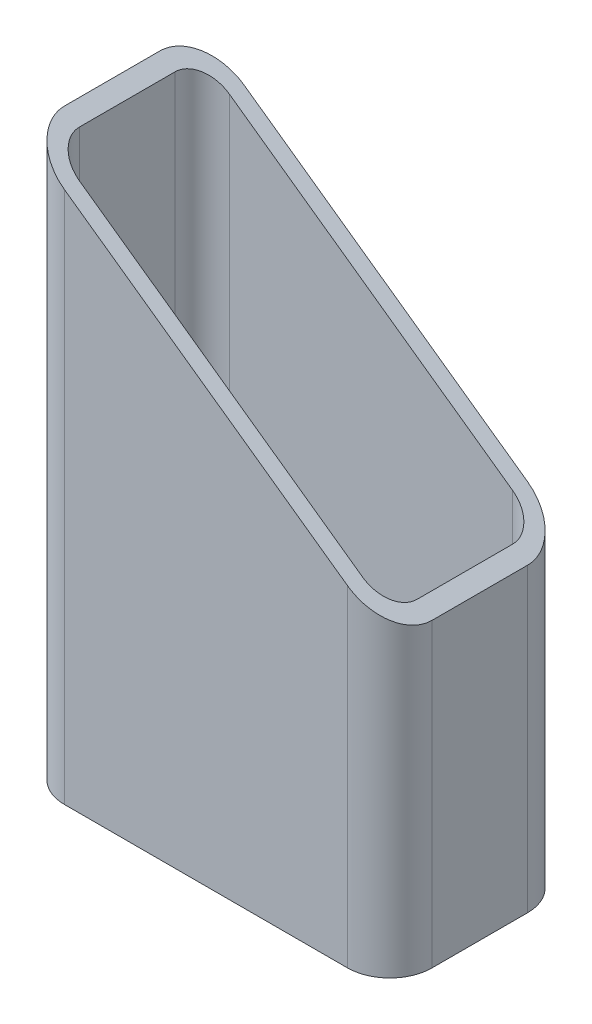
ISO-10303-21;
HEADER;
FILE_DESCRIPTION(('STEP AP214'),'2;1');
FILE_NAME('part.step','',(''),(''),'','','');
FILE_SCHEMA(('AUTOMOTIVE_DESIGN { 1 0 10303 214 1 1 1 1 }'));
ENDSEC;
DATA;
#1=APPLICATION_CONTEXT('core data for automotive mechanical design processes');
#2=APPLICATION_PROTOCOL_DEFINITION('international standard','automotive_design',2000,#1);
#3=PRODUCT_CONTEXT('',#1,'mechanical');
#4=PRODUCT('Part','Part','',(#3));
#5=PRODUCT_RELATED_PRODUCT_CATEGORY('part','',(#4));
#6=PRODUCT_DEFINITION_FORMATION('','',#4);
#7=PRODUCT_DEFINITION_CONTEXT('part definition',#1,'design');
#8=PRODUCT_DEFINITION('design','',#6,#7);
#9=PRODUCT_DEFINITION_SHAPE('','',#8);
#10=(LENGTH_UNIT() NAMED_UNIT(*) SI_UNIT(.MILLI.,.METRE.));
#11=(NAMED_UNIT(*) PLANE_ANGLE_UNIT() SI_UNIT($,.RADIAN.));
#12=(NAMED_UNIT(*) SI_UNIT($,.STERADIAN.) SOLID_ANGLE_UNIT());
#13=UNCERTAINTY_MEASURE_WITH_UNIT(LENGTH_MEASURE(1.E-05),#10,'distance_accuracy_value','');
#14=(GEOMETRIC_REPRESENTATION_CONTEXT(3) GLOBAL_UNCERTAINTY_ASSIGNED_CONTEXT((#13)) GLOBAL_UNIT_ASSIGNED_CONTEXT((#10,
#11,#12)) REPRESENTATION_CONTEXT('',''));
#15=CARTESIAN_POINT('',(0.,0.,0.));
#16=DIRECTION('',(0.,0.,1.));
#17=DIRECTION('',(1.,0.,0.));
#18=AXIS2_PLACEMENT_3D('',#15,#16,#17);
#19=CARTESIAN_POINT('',(90.,300.,0.));
#20=DIRECTION('',(1.,0.,0.));
#21=DIRECTION('',(0.,0.,-1.));
#22=AXIS2_PLACEMENT_3D('',#19,#20,#21);
#23=PLANE('',#22);
#24=DIRECTION('',(0.,-1.,0.));
#25=VECTOR('',#24,1.);
#26=CARTESIAN_POINT('',(90.,300.,25.5));
#27=LINE('',#26,#25);
#28=CARTESIAN_POINT('',(90.,166.197044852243,25.5));
#29=VERTEX_POINT('',#28);
#30=CARTESIAN_POINT('',(90.,0.,25.5));
#31=VERTEX_POINT('',#30);
#32=EDGE_CURVE('E13',#29,#31,#27,.T.);
#33=ORIENTED_EDGE('',*,*,#32,.F.);
#34=DIRECTION('',(0.,0.,-1.));
#35=VECTOR('',#34,1.);
#36=CARTESIAN_POINT('',(90.,166.197044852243,0.));
#37=LINE('',#36,#35);
#38=CARTESIAN_POINT('',(90.,166.197044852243,-25.5000000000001));
#39=VERTEX_POINT('',#38);
#40=EDGE_CURVE('E273',#29,#39,#37,.T.);
#41=ORIENTED_EDGE('',*,*,#40,.T.);
#42=DIRECTION('',(0.,-1.,0.));
#43=VECTOR('',#42,1.);
#44=CARTESIAN_POINT('',(90.,300.,-25.5000000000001));
#45=LINE('',#44,#43);
#46=CARTESIAN_POINT('',(90.,0.,-25.5000000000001));
#47=VERTEX_POINT('',#46);
#48=EDGE_CURVE('E136',#39,#47,#45,.T.);
#49=ORIENTED_EDGE('',*,*,#48,.T.);
#50=DIRECTION('',(0.,0.,1.));
#51=VECTOR('',#50,1.);
#52=CARTESIAN_POINT('',(90.,0.,0.));
#53=LINE('',#52,#51);
#54=EDGE_CURVE('E151',#47,#31,#53,.T.);
#55=ORIENTED_EDGE('',*,*,#54,.T.);
#56=EDGE_LOOP('',(#33,#41,#49,#55));
#57=FACE_BOUND('',#56,.T.);
#58=ADVANCED_FACE('F48',(#57),#23,.F.);
#59=CARTESIAN_POINT('',(75.5,300.,25.5));
#60=DIRECTION('',(0.,-1.,0.));
#61=DIRECTION('',(0.,0.,-1.));
#62=AXIS2_PLACEMENT_3D('',#59,#60,#61);
#63=CYLINDRICAL_SURFACE('',#62,14.5);
#64=DIRECTION('',(0.,-1.,0.));
#65=VECTOR('',#64,1.);
#66=CARTESIAN_POINT('',(75.5,300.,40.));
#67=LINE('',#66,#65);
#68=CARTESIAN_POINT('',(75.5,176.516953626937,40.));
#69=VERTEX_POINT('',#68);
#70=CARTESIAN_POINT('',(75.5,0.,40.));
#71=VERTEX_POINT('',#70);
#72=EDGE_CURVE('E57',#69,#71,#67,.T.);
#73=ORIENTED_EDGE('',*,*,#72,.F.);
#74=CARTESIAN_POINT('',(75.5,176.516953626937,25.5));
#75=DIRECTION('',(-0.579852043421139,-0.814721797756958,0.));
#76=DIRECTION('',(0.814721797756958,-0.579852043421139,0.));
#77=AXIS2_PLACEMENT_3D('',#74,#75,#76);
#78=ELLIPSE('',#77,17.797486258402,14.5);
#79=EDGE_CURVE('E268',#69,#29,#78,.F.);
#80=ORIENTED_EDGE('',*,*,#79,.T.);
#81=ORIENTED_EDGE('',*,*,#32,.T.);
#82=CARTESIAN_POINT('',(75.5,0.,25.5));
#83=DIRECTION('',(0.,1.,0.));
#84=DIRECTION('',(0.,0.,1.));
#85=AXIS2_PLACEMENT_3D('',#82,#83,#84);
#86=CIRCLE('',#85,14.5);
#87=EDGE_CURVE('E223',#31,#71,#86,.F.);
#88=ORIENTED_EDGE('',*,*,#87,.T.);
#89=EDGE_LOOP('',(#73,#80,#81,#88));
#90=FACE_BOUND('',#89,.T.);
#91=ADVANCED_FACE('F264',(#90),#63,.F.);
#92=CARTESIAN_POINT('',(0.,300.,40.));
#93=DIRECTION('',(0.,0.,-1.));
#94=DIRECTION('',(-1.,0.,0.));
#95=AXIS2_PLACEMENT_3D('',#92,#93,#94);
#96=PLANE('',#95);
#97=DIRECTION('',(-0.814721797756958,0.579852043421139,0.));
#98=VECTOR('',#97,1.);
#99=CARTESIAN_POINT('',(-32.9503824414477,253.703026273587,40.));
#100=LINE('',#99,#98);
#101=CARTESIAN_POINT('',(-75.5,283.986348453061,40.0000000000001));
#102=VERTEX_POINT('',#101);
#103=EDGE_CURVE('E261',#69,#102,#100,.T.);
#104=ORIENTED_EDGE('',*,*,#103,.F.);
#105=ORIENTED_EDGE('',*,*,#72,.T.);
#106=DIRECTION('',(1.,0.,0.));
#107=VECTOR('',#106,1.);
#108=CARTESIAN_POINT('',(0.,0.,40.));
#109=LINE('',#108,#107);
#110=CARTESIAN_POINT('',(-75.5,0.,40.0000000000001));
#111=VERTEX_POINT('',#110);
#112=EDGE_CURVE('E226',#111,#71,#109,.T.);
#113=ORIENTED_EDGE('',*,*,#112,.F.);
#114=DIRECTION('',(0.,-1.,0.));
#115=VECTOR('',#114,1.);
#116=CARTESIAN_POINT('',(-75.5,300.,40.0000000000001));
#117=LINE('',#116,#115);
#118=EDGE_CURVE('E164',#102,#111,#117,.T.);
#119=ORIENTED_EDGE('',*,*,#118,.F.);
#120=EDGE_LOOP('',(#104,#105,#113,#119));
#121=FACE_BOUND('',#120,.T.);
#122=ADVANCED_FACE('F256',(#121),#96,.T.);
#123=CARTESIAN_POINT('',(-75.5,300.,25.5000000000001));
#124=DIRECTION('',(0.,-1.,0.));
#125=DIRECTION('',(0.,0.,-1.));
#126=AXIS2_PLACEMENT_3D('',#123,#124,#125);
#127=CYLINDRICAL_SURFACE('',#126,14.5);
#128=CARTESIAN_POINT('',(-75.5,283.986348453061,25.5000000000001));
#129=DIRECTION('',(-0.579852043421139,-0.814721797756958,0.));
#130=DIRECTION('',(0.814721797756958,-0.579852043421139,0.));
#131=AXIS2_PLACEMENT_3D('',#128,#129,#130);
#132=ELLIPSE('',#131,17.797486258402,14.5);
#133=CARTESIAN_POINT('',(-90.,294.306257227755,25.5000000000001));
#134=VERTEX_POINT('',#133);
#135=EDGE_CURVE('E584',#102,#134,#132,.T.);
#136=ORIENTED_EDGE('',*,*,#135,.F.);
#137=ORIENTED_EDGE('',*,*,#118,.T.);
#138=CARTESIAN_POINT('',(-75.5,0.,25.5000000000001));
#139=DIRECTION('',(0.,1.,0.));
#140=DIRECTION('',(0.,0.,1.));
#141=AXIS2_PLACEMENT_3D('',#138,#139,#140);
#142=CIRCLE('',#141,14.5);
#143=CARTESIAN_POINT('',(-90.,0.,25.5000000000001));
#144=VERTEX_POINT('',#143);
#145=EDGE_CURVE('E229',#144,#111,#142,.T.);
#146=ORIENTED_EDGE('',*,*,#145,.F.);
#147=DIRECTION('',(0.,-1.,0.));
#148=VECTOR('',#147,1.);
#149=CARTESIAN_POINT('',(-90.,300.,25.5000000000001));
#150=LINE('',#149,#148);
#151=EDGE_CURVE('E162',#134,#144,#150,.T.);
#152=ORIENTED_EDGE('',*,*,#151,.F.);
#153=EDGE_LOOP('',(#136,#137,#146,#152));
#154=FACE_BOUND('',#153,.T.);
#155=ADVANCED_FACE('F251',(#154),#127,.F.);
#156=CARTESIAN_POINT('',(-90.,300.,0.));
#157=DIRECTION('',(1.,0.,0.));
#158=DIRECTION('',(0.,0.,-1.));
#159=AXIS2_PLACEMENT_3D('',#156,#157,#158);
#160=PLANE('',#159);
#161=DIRECTION('',(0.,0.,-1.));
#162=VECTOR('',#161,1.);
#163=CARTESIAN_POINT('',(-90.,294.306257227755,0.));
#164=LINE('',#163,#162);
#165=CARTESIAN_POINT('',(-90.,294.306257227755,-25.5000000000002));
#166=VERTEX_POINT('',#165);
#167=EDGE_CURVE('E248',#134,#166,#164,.T.);
#168=ORIENTED_EDGE('',*,*,#167,.F.);
#169=ORIENTED_EDGE('',*,*,#151,.T.);
#170=DIRECTION('',(0.,0.,1.));
#171=VECTOR('',#170,1.);
#172=CARTESIAN_POINT('',(-90.,0.,0.));
#173=LINE('',#172,#171);
#174=CARTESIAN_POINT('',(-90.,0.,-25.5000000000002));
#175=VERTEX_POINT('',#174);
#176=EDGE_CURVE('E232',#175,#144,#173,.T.);
#177=ORIENTED_EDGE('',*,*,#176,.F.);
#178=DIRECTION('',(0.,-1.,0.));
#179=VECTOR('',#178,1.);
#180=CARTESIAN_POINT('',(-90.,300.,-25.5000000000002));
#181=LINE('',#180,#179);
#182=EDGE_CURVE('E160',#166,#175,#181,.T.);
#183=ORIENTED_EDGE('',*,*,#182,.F.);
#184=EDGE_LOOP('',(#168,#169,#177,#183));
#185=FACE_BOUND('',#184,.T.);
#186=ADVANCED_FACE('F242',(#185),#160,.T.);
#187=CARTESIAN_POINT('',(-75.5,300.,-25.5000000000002));
#188=DIRECTION('',(0.,-1.,0.));
#189=DIRECTION('',(0.,0.,-1.));
#190=AXIS2_PLACEMENT_3D('',#187,#188,#189);
#191=CYLINDRICAL_SURFACE('',#190,14.5);
#192=DIRECTION('',(0.,-1.,0.));
#193=VECTOR('',#192,1.);
#194=CARTESIAN_POINT('',(-75.5,300.,-40.0000000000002));
#195=LINE('',#194,#193);
#196=CARTESIAN_POINT('',(-75.5,283.986348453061,-40.0000000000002));
#197=VERTEX_POINT('',#196);
#198=CARTESIAN_POINT('',(-75.5,0.,-40.0000000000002));
#199=VERTEX_POINT('',#198);
#200=EDGE_CURVE('E135',#197,#199,#195,.T.);
#201=ORIENTED_EDGE('',*,*,#200,.F.);
#202=CARTESIAN_POINT('',(-75.5,283.986348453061,-25.5000000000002));
#203=DIRECTION('',(-0.579852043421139,-0.814721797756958,0.));
#204=DIRECTION('',(0.814721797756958,-0.579852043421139,0.));
#205=AXIS2_PLACEMENT_3D('',#202,#203,#204);
#206=ELLIPSE('',#205,17.797486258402,14.5);
#207=EDGE_CURVE('E587',#197,#166,#206,.F.);
#208=ORIENTED_EDGE('',*,*,#207,.T.);
#209=ORIENTED_EDGE('',*,*,#182,.T.);
#210=CARTESIAN_POINT('',(-75.5,0.,-25.5000000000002));
#211=DIRECTION('',(0.,1.,0.));
#212=DIRECTION('',(0.,0.,1.));
#213=AXIS2_PLACEMENT_3D('',#210,#211,#212);
#214=CIRCLE('',#213,14.5);
#215=EDGE_CURVE('E145',#175,#199,#214,.F.);
#216=ORIENTED_EDGE('',*,*,#215,.T.);
#217=EDGE_LOOP('',(#201,#208,#209,#216));
#218=FACE_BOUND('',#217,.T.);
#219=ADVANCED_FACE('F235',(#218),#191,.F.);
#220=CARTESIAN_POINT('',(0.,300.,-40.0000000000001));
#221=DIRECTION('',(0.,0.,-1.));
#222=DIRECTION('',(-1.,0.,0.));
#223=AXIS2_PLACEMENT_3D('',#220,#221,#222);
#224=PLANE('',#223);
#225=DIRECTION('',(0.,-1.,0.));
#226=VECTOR('',#225,1.);
#227=CARTESIAN_POINT('',(75.5,300.,-40.0000000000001));
#228=LINE('',#227,#226);
#229=CARTESIAN_POINT('',(75.5,176.516953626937,-40.0000000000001));
#230=VERTEX_POINT('',#229);
#231=CARTESIAN_POINT('',(75.5,0.,-40.0000000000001));
#232=VERTEX_POINT('',#231);
#233=EDGE_CURVE('E127',#230,#232,#228,.T.);
#234=ORIENTED_EDGE('',*,*,#233,.F.);
#235=DIRECTION('',(-0.814721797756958,0.579852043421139,0.));
#236=VECTOR('',#235,1.);
#237=CARTESIAN_POINT('',(-32.9503824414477,253.703026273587,-40.0000000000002));
#238=LINE('',#237,#236);
#239=EDGE_CURVE('E65',#230,#197,#238,.T.);
#240=ORIENTED_EDGE('',*,*,#239,.T.);
#241=ORIENTED_EDGE('',*,*,#200,.T.);
#242=DIRECTION('',(1.,0.,0.));
#243=VECTOR('',#242,1.);
#244=CARTESIAN_POINT('',(0.,0.,-40.0000000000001));
#245=LINE('',#244,#243);
#246=EDGE_CURVE('E139',#199,#232,#245,.T.);
#247=ORIENTED_EDGE('',*,*,#246,.T.);
#248=EDGE_LOOP('',(#234,#240,#241,#247));
#249=FACE_BOUND('',#248,.T.);
#250=ADVANCED_FACE('F140',(#249),#224,.F.);
#251=CARTESIAN_POINT('',(75.5,300.,25.5));
#252=DIRECTION('',(0.,-1.,0.));
#253=DIRECTION('',(0.,0.,-1.));
#254=AXIS2_PLACEMENT_3D('',#251,#252,#253);
#255=CYLINDRICAL_SURFACE('',#254,22.5);
#256=CARTESIAN_POINT('',(75.5,176.516953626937,25.5));
#257=DIRECTION('',(-0.579852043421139,-0.814721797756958,0.));
#258=DIRECTION('',(0.814721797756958,-0.579852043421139,0.));
#259=AXIS2_PLACEMENT_3D('',#256,#257,#258);
#260=ELLIPSE('',#259,27.6167890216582,22.5);
#261=CARTESIAN_POINT('',(75.5,176.516953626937,48.));
#262=VERTEX_POINT('',#261);
#263=CARTESIAN_POINT('',(98.,160.503302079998,25.5));
#264=VERTEX_POINT('',#263);
#265=EDGE_CURVE('E203',#262,#264,#260,.F.);
#266=ORIENTED_EDGE('',*,*,#265,.F.);
#267=DIRECTION('',(0.,-1.,0.));
#268=VECTOR('',#267,1.);
#269=CARTESIAN_POINT('',(75.5,300.,48.));
#270=LINE('',#269,#268);
#271=CARTESIAN_POINT('',(75.5,0.,48.));
#272=VERTEX_POINT('',#271);
#273=EDGE_CURVE('E154',#262,#272,#270,.T.);
#274=ORIENTED_EDGE('',*,*,#273,.T.);
#275=CARTESIAN_POINT('',(75.5,0.,25.5));
#276=DIRECTION('',(0.,1.,0.));
#277=DIRECTION('',(0.,0.,1.));
#278=AXIS2_PLACEMENT_3D('',#275,#276,#277);
#279=CIRCLE('',#278,22.5);
#280=CARTESIAN_POINT('',(98.,0.,25.5));
#281=VERTEX_POINT('',#280);
#282=EDGE_CURVE('E198',#281,#272,#279,.F.);
#283=ORIENTED_EDGE('',*,*,#282,.F.);
#284=DIRECTION('',(0.,-1.,0.));
#285=VECTOR('',#284,1.);
#286=CARTESIAN_POINT('',(98.,300.,25.5));
#287=LINE('',#286,#285);
#288=EDGE_CURVE('E52',#264,#281,#287,.T.);
#289=ORIENTED_EDGE('',*,*,#288,.F.);
#290=EDGE_LOOP('',(#266,#274,#283,#289));
#291=FACE_BOUND('',#290,.T.);
#292=ADVANCED_FACE('F50',(#291),#255,.T.);
#293=CARTESIAN_POINT('',(98.,300.,0.));
#294=DIRECTION('',(1.,0.,0.));
#295=DIRECTION('',(0.,0.,-1.));
#296=AXIS2_PLACEMENT_3D('',#293,#294,#295);
#297=PLANE('',#296);
#298=DIRECTION('',(0.,0.,1.));
#299=VECTOR('',#298,1.);
#300=CARTESIAN_POINT('',(98.,160.503302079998,-252.));
#301=LINE('',#300,#299);
#302=CARTESIAN_POINT('',(98.,160.503302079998,-25.5000000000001));
#303=VERTEX_POINT('',#302);
#304=EDGE_CURVE('E194',#303,#264,#301,.T.);
#305=ORIENTED_EDGE('',*,*,#304,.T.);
#306=ORIENTED_EDGE('',*,*,#288,.T.);
#307=DIRECTION('',(0.,0.,1.));
#308=VECTOR('',#307,1.);
#309=CARTESIAN_POINT('',(98.,0.,0.));
#310=LINE('',#309,#308);
#311=CARTESIAN_POINT('',(98.,0.,-25.5000000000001));
#312=VERTEX_POINT('',#311);
#313=EDGE_CURVE('E191',#312,#281,#310,.T.);
#314=ORIENTED_EDGE('',*,*,#313,.F.);
#315=DIRECTION('',(0.,-1.,0.));
#316=VECTOR('',#315,1.);
#317=CARTESIAN_POINT('',(98.,300.,-25.5000000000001));
#318=LINE('',#317,#316);
#319=EDGE_CURVE('E178',#303,#312,#318,.T.);
#320=ORIENTED_EDGE('',*,*,#319,.F.);
#321=EDGE_LOOP('',(#305,#306,#314,#320));
#322=FACE_BOUND('',#321,.T.);
#323=ADVANCED_FACE('F189',(#322),#297,.T.);
#324=CARTESIAN_POINT('',(75.5,300.,-25.5000000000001));
#325=DIRECTION('',(0.,-1.,0.));
#326=DIRECTION('',(0.,0.,-1.));
#327=AXIS2_PLACEMENT_3D('',#324,#325,#326);
#328=CYLINDRICAL_SURFACE('',#327,22.5);
#329=DIRECTION('',(0.,-1.,0.));
#330=VECTOR('',#329,1.);
#331=CARTESIAN_POINT('',(75.5,300.,-48.0000000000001));
#332=LINE('',#331,#330);
#333=CARTESIAN_POINT('',(75.5,176.516953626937,-48.0000000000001));
#334=VERTEX_POINT('',#333);
#335=CARTESIAN_POINT('',(75.5,0.,-48.0000000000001));
#336=VERTEX_POINT('',#335);
#337=EDGE_CURVE('E177',#334,#336,#332,.T.);
#338=ORIENTED_EDGE('',*,*,#337,.F.);
#339=CARTESIAN_POINT('',(75.5,176.516953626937,-25.5000000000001));
#340=DIRECTION('',(-0.579852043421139,-0.814721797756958,0.));
#341=DIRECTION('',(0.814721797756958,-0.579852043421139,0.));
#342=AXIS2_PLACEMENT_3D('',#339,#340,#341);
#343=ELLIPSE('',#342,27.6167890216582,22.5);
#344=EDGE_CURVE('E575',#334,#303,#343,.T.);
#345=ORIENTED_EDGE('',*,*,#344,.T.);
#346=ORIENTED_EDGE('',*,*,#319,.T.);
#347=CARTESIAN_POINT('',(75.5,0.,-25.5000000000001));
#348=DIRECTION('',(0.,1.,0.));
#349=DIRECTION('',(0.,0.,1.));
#350=AXIS2_PLACEMENT_3D('',#347,#348,#349);
#351=CIRCLE('',#350,22.5);
#352=EDGE_CURVE('E206',#312,#336,#351,.T.);
#353=ORIENTED_EDGE('',*,*,#352,.T.);
#354=EDGE_LOOP('',(#338,#345,#346,#353));
#355=FACE_BOUND('',#354,.T.);
#356=ADVANCED_FACE('F322',(#355),#328,.T.);
#357=CARTESIAN_POINT('',(0.,300.,-48.0000000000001));
#358=DIRECTION('',(0.,0.,-1.));
#359=DIRECTION('',(-1.,0.,0.));
#360=AXIS2_PLACEMENT_3D('',#357,#358,#359);
#361=PLANE('',#360);
#362=DIRECTION('',(-0.814721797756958,0.579852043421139,0.));
#363=VECTOR('',#362,1.);
#364=CARTESIAN_POINT('',(-32.9503824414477,253.703026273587,-48.0000000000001));
#365=LINE('',#364,#363);
#366=CARTESIAN_POINT('',(-75.5,283.986348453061,-48.0000000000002));
#367=VERTEX_POINT('',#366);
#368=EDGE_CURVE('E321',#334,#367,#365,.T.);
#369=ORIENTED_EDGE('',*,*,#368,.F.);
#370=ORIENTED_EDGE('',*,*,#337,.T.);
#371=DIRECTION('',(1.,0.,0.));
#372=VECTOR('',#371,1.);
#373=CARTESIAN_POINT('',(0.,0.,-48.0000000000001));
#374=LINE('',#373,#372);
#375=CARTESIAN_POINT('',(-75.5,0.,-48.0000000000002));
#376=VERTEX_POINT('',#375);
#377=EDGE_CURVE('E208',#376,#336,#374,.T.);
#378=ORIENTED_EDGE('',*,*,#377,.F.);
#379=DIRECTION('',(0.,-1.,0.));
#380=VECTOR('',#379,1.);
#381=CARTESIAN_POINT('',(-75.5,300.,-48.0000000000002));
#382=LINE('',#381,#380);
#383=EDGE_CURVE('E175',#367,#376,#382,.T.);
#384=ORIENTED_EDGE('',*,*,#383,.F.);
#385=EDGE_LOOP('',(#369,#370,#378,#384));
#386=FACE_BOUND('',#385,.T.);
#387=ADVANCED_FACE('F319',(#386),#361,.T.);
#388=CARTESIAN_POINT('',(-75.5,300.,-25.5000000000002));
#389=DIRECTION('',(0.,-1.,0.));
#390=DIRECTION('',(0.,0.,-1.));
#391=AXIS2_PLACEMENT_3D('',#388,#389,#390);
#392=CYLINDRICAL_SURFACE('',#391,22.5);
#393=CARTESIAN_POINT('',(-75.5,283.986348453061,-25.5000000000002));
#394=DIRECTION('',(-0.579852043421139,-0.814721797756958,0.));
#395=DIRECTION('',(0.814721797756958,-0.579852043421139,0.));
#396=AXIS2_PLACEMENT_3D('',#393,#394,#395);
#397=ELLIPSE('',#396,27.6167890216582,22.5);
#398=CARTESIAN_POINT('',(-98.,300.,-25.5000000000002));
#399=VERTEX_POINT('',#398);
#400=EDGE_CURVE('E74',#367,#399,#397,.F.);
#401=ORIENTED_EDGE('',*,*,#400,.F.);
#402=ORIENTED_EDGE('',*,*,#383,.T.);
#403=CARTESIAN_POINT('',(-75.5,0.,-25.5000000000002));
#404=DIRECTION('',(0.,1.,0.));
#405=DIRECTION('',(0.,0.,1.));
#406=AXIS2_PLACEMENT_3D('',#403,#404,#405);
#407=CIRCLE('',#406,22.5);
#408=CARTESIAN_POINT('',(-98.,0.,-25.5000000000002));
#409=VERTEX_POINT('',#408);
#410=EDGE_CURVE('E212',#409,#376,#407,.F.);
#411=ORIENTED_EDGE('',*,*,#410,.F.);
#412=DIRECTION('',(0.,-1.,0.));
#413=VECTOR('',#412,1.);
#414=CARTESIAN_POINT('',(-98.,300.,-25.5000000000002));
#415=LINE('',#414,#413);
#416=EDGE_CURVE('E173',#399,#409,#415,.T.);
#417=ORIENTED_EDGE('',*,*,#416,.F.);
#418=EDGE_LOOP('',(#401,#402,#411,#417));
#419=FACE_BOUND('',#418,.T.);
#420=ADVANCED_FACE('F314',(#419),#392,.T.);
#421=CARTESIAN_POINT('',(-98.,300.,0.));
#422=DIRECTION('',(1.,0.,0.));
#423=DIRECTION('',(0.,0.,-1.));
#424=AXIS2_PLACEMENT_3D('',#421,#422,#423);
#425=PLANE('',#424);
#426=DIRECTION('',(0.,0.,1.));
#427=VECTOR('',#426,1.);
#428=CARTESIAN_POINT('',(-98.,0.,0.));
#429=LINE('',#428,#427);
#430=CARTESIAN_POINT('',(-98.,0.,25.5000000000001));
#431=VERTEX_POINT('',#430);
#432=EDGE_CURVE('E215',#409,#431,#429,.T.);
#433=ORIENTED_EDGE('',*,*,#432,.T.);
#434=DIRECTION('',(0.,-1.,0.));
#435=VECTOR('',#434,1.);
#436=CARTESIAN_POINT('',(-98.,300.,25.5000000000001));
#437=LINE('',#436,#435);
#438=CARTESIAN_POINT('',(-98.,300.,25.5000000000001));
#439=VERTEX_POINT('',#438);
#440=EDGE_CURVE('E170',#439,#431,#437,.T.);
#441=ORIENTED_EDGE('',*,*,#440,.F.);
#442=DIRECTION('',(0.,0.,1.));
#443=VECTOR('',#442,1.);
#444=CARTESIAN_POINT('',(-98.,300.,0.));
#445=LINE('',#444,#443);
#446=EDGE_CURVE('E152',#399,#439,#445,.T.);
#447=ORIENTED_EDGE('',*,*,#446,.F.);
#448=ORIENTED_EDGE('',*,*,#416,.T.);
#449=EDGE_LOOP('',(#433,#441,#447,#448));
#450=FACE_BOUND('',#449,.T.);
#451=ADVANCED_FACE('F342',(#450),#425,.F.);
#452=CARTESIAN_POINT('',(-75.5,300.,25.5000000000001));
#453=DIRECTION('',(0.,-1.,0.));
#454=DIRECTION('',(0.,0.,-1.));
#455=AXIS2_PLACEMENT_3D('',#452,#453,#454);
#456=CYLINDRICAL_SURFACE('',#455,22.5);
#457=DIRECTION('',(0.,-1.,0.));
#458=VECTOR('',#457,1.);
#459=CARTESIAN_POINT('',(-75.5,300.,48.0000000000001));
#460=LINE('',#459,#458);
#461=CARTESIAN_POINT('',(-75.5,283.986348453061,48.));
#462=VERTEX_POINT('',#461);
#463=CARTESIAN_POINT('',(-75.5,0.,48.0000000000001));
#464=VERTEX_POINT('',#463);
#465=EDGE_CURVE('E168',#462,#464,#460,.T.);
#466=ORIENTED_EDGE('',*,*,#465,.F.);
#467=CARTESIAN_POINT('',(-75.5,283.986348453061,25.5000000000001));
#468=DIRECTION('',(-0.579852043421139,-0.814721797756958,0.));
#469=DIRECTION('',(0.814721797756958,-0.579852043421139,0.));
#470=AXIS2_PLACEMENT_3D('',#467,#468,#469);
#471=ELLIPSE('',#470,27.6167890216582,22.5);
#472=EDGE_CURVE('E296',#462,#439,#471,.T.);
#473=ORIENTED_EDGE('',*,*,#472,.T.);
#474=ORIENTED_EDGE('',*,*,#440,.T.);
#475=CARTESIAN_POINT('',(-75.5,0.,25.5000000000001));
#476=DIRECTION('',(0.,1.,0.));
#477=DIRECTION('',(0.,0.,1.));
#478=AXIS2_PLACEMENT_3D('',#475,#476,#477);
#479=CIRCLE('',#478,22.5);
#480=EDGE_CURVE('E217',#431,#464,#479,.T.);
#481=ORIENTED_EDGE('',*,*,#480,.T.);
#482=EDGE_LOOP('',(#466,#473,#474,#481));
#483=FACE_BOUND('',#482,.T.);
#484=ADVANCED_FACE('F308',(#483),#456,.T.);
#485=CARTESIAN_POINT('',(0.,300.,48.));
#486=DIRECTION('',(0.,0.,-1.));
#487=DIRECTION('',(-1.,0.,0.));
#488=AXIS2_PLACEMENT_3D('',#485,#486,#487);
#489=PLANE('',#488);
#490=ORIENTED_EDGE('',*,*,#273,.F.);
#491=DIRECTION('',(0.814721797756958,-0.579852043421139,0.));
#492=VECTOR('',#491,1.);
#493=CARTESIAN_POINT('',(-98.,300.,48.));
#494=LINE('',#493,#492);
#495=EDGE_CURVE('E299',#462,#262,#494,.T.);
#496=ORIENTED_EDGE('',*,*,#495,.F.);
#497=ORIENTED_EDGE('',*,*,#465,.T.);
#498=DIRECTION('',(1.,0.,0.));
#499=VECTOR('',#498,1.);
#500=CARTESIAN_POINT('',(0.,0.,48.));
#501=LINE('',#500,#499);
#502=EDGE_CURVE('E220',#464,#272,#501,.T.);
#503=ORIENTED_EDGE('',*,*,#502,.T.);
#504=EDGE_LOOP('',(#490,#496,#497,#503));
#505=FACE_BOUND('',#504,.T.);
#506=ADVANCED_FACE('F306',(#505),#489,.F.);
#507=CARTESIAN_POINT('',(75.5,300.,-25.5000000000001));
#508=DIRECTION('',(0.,-1.,0.));
#509=DIRECTION('',(0.,0.,-1.));
#510=AXIS2_PLACEMENT_3D('',#507,#508,#509);
#511=CYLINDRICAL_SURFACE('',#510,14.5);
#512=CARTESIAN_POINT('',(75.5,176.516953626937,-25.5000000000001));
#513=DIRECTION('',(-0.579852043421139,-0.814721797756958,0.));
#514=DIRECTION('',(0.814721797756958,-0.579852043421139,0.));
#515=AXIS2_PLACEMENT_3D('',#512,#513,#514);
#516=ELLIPSE('',#515,17.797486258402,14.5);
#517=EDGE_CURVE('E133',#230,#39,#516,.T.);
#518=ORIENTED_EDGE('',*,*,#517,.F.);
#519=ORIENTED_EDGE('',*,*,#233,.T.);
#520=CARTESIAN_POINT('',(75.5,0.,-25.5000000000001));
#521=DIRECTION('',(0.,1.,0.));
#522=DIRECTION('',(0.,0.,1.));
#523=AXIS2_PLACEMENT_3D('',#520,#521,#522);
#524=CIRCLE('',#523,14.5);
#525=EDGE_CURVE('E132',#47,#232,#524,.T.);
#526=ORIENTED_EDGE('',*,*,#525,.F.);
#527=ORIENTED_EDGE('',*,*,#48,.F.);
#528=EDGE_LOOP('',(#518,#519,#526,#527));
#529=FACE_BOUND('',#528,.T.);
#530=ADVANCED_FACE('F129',(#529),#511,.F.);
#531=CARTESIAN_POINT('',(0.,0.,0.));
#532=DIRECTION('',(0.,1.,0.));
#533=DIRECTION('',(0.,0.,1.));
#534=AXIS2_PLACEMENT_3D('',#531,#532,#533);
#535=PLANE('',#534);
#536=ORIENTED_EDGE('',*,*,#282,.T.);
#537=ORIENTED_EDGE('',*,*,#502,.F.);
#538=ORIENTED_EDGE('',*,*,#480,.F.);
#539=ORIENTED_EDGE('',*,*,#432,.F.);
#540=ORIENTED_EDGE('',*,*,#410,.T.);
#541=ORIENTED_EDGE('',*,*,#377,.T.);
#542=ORIENTED_EDGE('',*,*,#352,.F.);
#543=ORIENTED_EDGE('',*,*,#313,.T.);
#544=EDGE_LOOP('',(#536,#537,#538,#539,#540,#541,#542,#543));
#545=FACE_BOUND('',#544,.T.);
#546=ORIENTED_EDGE('',*,*,#54,.F.);
#547=ORIENTED_EDGE('',*,*,#525,.T.);
#548=ORIENTED_EDGE('',*,*,#246,.F.);
#549=ORIENTED_EDGE('',*,*,#215,.F.);
#550=ORIENTED_EDGE('',*,*,#176,.T.);
#551=ORIENTED_EDGE('',*,*,#145,.T.);
#552=ORIENTED_EDGE('',*,*,#112,.T.);
#553=ORIENTED_EDGE('',*,*,#87,.F.);
#554=EDGE_LOOP('',(#546,#547,#548,#549,#550,#551,#552,#553));
#555=FACE_BOUND('',#554,.T.);
#556=ADVANCED_FACE('F148',(#545,#555),#535,.F.);
#557=CARTESIAN_POINT('',(-98.,300.,-252.));
#558=DIRECTION('',(-0.579852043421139,-0.814721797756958,0.));
#559=DIRECTION('',(0.814721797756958,-0.579852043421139,0.));
#560=AXIS2_PLACEMENT_3D('',#557,#558,#559);
#561=PLANE('',#560);
#562=ORIENTED_EDGE('',*,*,#265,.T.);
#563=ORIENTED_EDGE('',*,*,#304,.F.);
#564=ORIENTED_EDGE('',*,*,#344,.F.);
#565=ORIENTED_EDGE('',*,*,#368,.T.);
#566=ORIENTED_EDGE('',*,*,#400,.T.);
#567=ORIENTED_EDGE('',*,*,#446,.T.);
#568=ORIENTED_EDGE('',*,*,#472,.F.);
#569=ORIENTED_EDGE('',*,*,#495,.T.);
#570=EDGE_LOOP('',(#562,#563,#564,#565,#566,#567,#568,#569));
#571=FACE_BOUND('',#570,.T.);
#572=ORIENTED_EDGE('',*,*,#79,.F.);
#573=ORIENTED_EDGE('',*,*,#103,.T.);
#574=ORIENTED_EDGE('',*,*,#135,.T.);
#575=ORIENTED_EDGE('',*,*,#167,.T.);
#576=ORIENTED_EDGE('',*,*,#207,.F.);
#577=ORIENTED_EDGE('',*,*,#239,.F.);
#578=ORIENTED_EDGE('',*,*,#517,.T.);
#579=ORIENTED_EDGE('',*,*,#40,.F.);
#580=EDGE_LOOP('',(#572,#573,#574,#575,#576,#577,#578,#579));
#581=FACE_BOUND('',#580,.T.);
#582=ADVANCED_FACE('F298',(#571,#581),#561,.F.);
#583=CLOSED_SHELL('',(#58,#91,#122,#155,#186,#219,#250,#292,#323,#356,#387,#420,#451,#484,#506,
#530,#556,#582));
#584=MANIFOLD_SOLID_BREP('B2',#583);
#585=ADVANCED_BREP_SHAPE_REPRESENTATION('',(#18,#584),#14);
#586=SHAPE_DEFINITION_REPRESENTATION(#9,#585);
ENDSEC;
END-ISO-10303-21;
